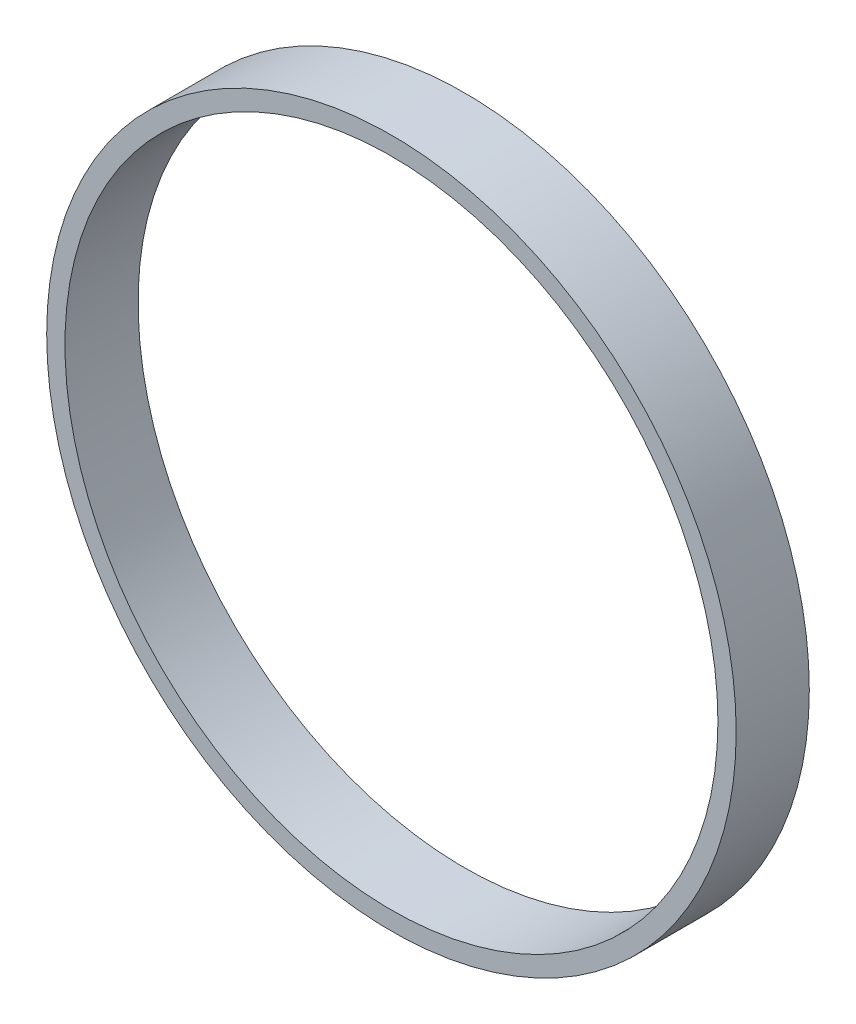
ISO-10303-21;
HEADER;
FILE_DESCRIPTION(('STEP AP214'),'2;1');
FILE_NAME('part.step','',(''),(''),'','','');
FILE_SCHEMA(('AUTOMOTIVE_DESIGN { 1 0 10303 214 1 1 1 1 }'));
ENDSEC;
DATA;
#1=APPLICATION_CONTEXT('core data for automotive mechanical design processes');
#2=APPLICATION_PROTOCOL_DEFINITION('international standard','automotive_design',2000,#1);
#3=PRODUCT_CONTEXT('',#1,'mechanical');
#4=PRODUCT('Part','Part','',(#3));
#5=PRODUCT_RELATED_PRODUCT_CATEGORY('part','',(#4));
#6=PRODUCT_DEFINITION_FORMATION('','',#4);
#7=PRODUCT_DEFINITION_CONTEXT('part definition',#1,'design');
#8=PRODUCT_DEFINITION('design','',#6,#7);
#9=PRODUCT_DEFINITION_SHAPE('','',#8);
#10=(LENGTH_UNIT() NAMED_UNIT(*) SI_UNIT(.MILLI.,.METRE.));
#11=(NAMED_UNIT(*) PLANE_ANGLE_UNIT() SI_UNIT($,.RADIAN.));
#12=(NAMED_UNIT(*) SI_UNIT($,.STERADIAN.) SOLID_ANGLE_UNIT());
#13=UNCERTAINTY_MEASURE_WITH_UNIT(LENGTH_MEASURE(1.E-05),#10,'distance_accuracy_value','');
#14=(GEOMETRIC_REPRESENTATION_CONTEXT(3) GLOBAL_UNCERTAINTY_ASSIGNED_CONTEXT((#13)) GLOBAL_UNIT_ASSIGNED_CONTEXT((#10,
#11,#12)) REPRESENTATION_CONTEXT('',''));
#15=CARTESIAN_POINT('',(0.,0.,0.));
#16=DIRECTION('',(0.,0.,1.));
#17=DIRECTION('',(1.,0.,0.));
#18=AXIS2_PLACEMENT_3D('',#15,#16,#17);
#19=CARTESIAN_POINT('',(0.,0.,3.5));
#20=DIRECTION('',(0.,0.,1.));
#21=DIRECTION('',(1.,0.,0.));
#22=AXIS2_PLACEMENT_3D('',#19,#20,#21);
#23=PLANE('',#22);
#24=CARTESIAN_POINT('',(0.,0.,3.5));
#25=DIRECTION('',(0.,0.,1.));
#26=DIRECTION('',(1.,0.,0.));
#27=AXIS2_PLACEMENT_3D('',#24,#25,#26);
#28=CIRCLE('',#27,33.);
#29=CARTESIAN_POINT('',(33.,0.,3.5));
#30=VERTEX_POINT('',#29);
#31=EDGE_CURVE('E10',#30,#30,#28,.T.);
#32=ORIENTED_EDGE('',*,*,#31,.T.);
#33=EDGE_LOOP('',(#32));
#34=FACE_BOUND('',#33,.T.);
#35=CARTESIAN_POINT('',(0.,0.,3.5));
#36=DIRECTION('',(0.,0.,1.));
#37=DIRECTION('',(1.,0.,0.));
#38=AXIS2_PLACEMENT_3D('',#35,#36,#37);
#39=CIRCLE('',#38,31.25);
#40=CARTESIAN_POINT('',(31.25,0.,3.5));
#41=VERTEX_POINT('',#40);
#42=EDGE_CURVE('E54',#41,#41,#39,.T.);
#43=ORIENTED_EDGE('',*,*,#42,.F.);
#44=EDGE_LOOP('',(#43));
#45=FACE_BOUND('',#44,.T.);
#46=ADVANCED_FACE('F41',(#34,#45),#23,.T.);
#47=CARTESIAN_POINT('',(0.,0.,-3.5));
#48=DIRECTION('',(0.,0.,1.));
#49=DIRECTION('',(1.,0.,0.));
#50=AXIS2_PLACEMENT_3D('',#47,#48,#49);
#51=PLANE('',#50);
#52=CARTESIAN_POINT('',(0.,0.,-3.5));
#53=DIRECTION('',(0.,0.,1.));
#54=DIRECTION('',(1.,0.,0.));
#55=AXIS2_PLACEMENT_3D('',#52,#53,#54);
#56=CIRCLE('',#55,33.);
#57=CARTESIAN_POINT('',(33.,0.,-3.5));
#58=VERTEX_POINT('',#57);
#59=EDGE_CURVE('E45',#58,#58,#56,.T.);
#60=ORIENTED_EDGE('',*,*,#59,.F.);
#61=EDGE_LOOP('',(#60));
#62=FACE_BOUND('',#61,.T.);
#63=CARTESIAN_POINT('',(0.,0.,-3.5));
#64=DIRECTION('',(0.,0.,1.));
#65=DIRECTION('',(1.,0.,0.));
#66=AXIS2_PLACEMENT_3D('',#63,#64,#65);
#67=CIRCLE('',#66,31.25);
#68=CARTESIAN_POINT('',(31.25,0.,-3.5));
#69=VERTEX_POINT('',#68);
#70=EDGE_CURVE('E56',#69,#69,#67,.T.);
#71=ORIENTED_EDGE('',*,*,#70,.T.);
#72=EDGE_LOOP('',(#71));
#73=FACE_BOUND('',#72,.T.);
#74=ADVANCED_FACE('F68',(#62,#73),#51,.F.);
#75=CARTESIAN_POINT('',(0.,0.,3.5));
#76=DIRECTION('',(0.,0.,-1.));
#77=DIRECTION('',(-1.,0.,0.));
#78=AXIS2_PLACEMENT_3D('',#75,#76,#77);
#79=CYLINDRICAL_SURFACE('',#78,33.);
#80=ORIENTED_EDGE('',*,*,#31,.F.);
#81=EDGE_LOOP('',(#80));
#82=FACE_BOUND('',#81,.T.);
#83=ORIENTED_EDGE('',*,*,#59,.T.);
#84=EDGE_LOOP('',(#83));
#85=FACE_BOUND('',#84,.T.);
#86=ADVANCED_FACE('F43',(#82,#85),#79,.T.);
#87=CARTESIAN_POINT('',(0.,0.,3.5));
#88=DIRECTION('',(0.,0.,-1.));
#89=DIRECTION('',(-1.,0.,0.));
#90=AXIS2_PLACEMENT_3D('',#87,#88,#89);
#91=CYLINDRICAL_SURFACE('',#90,31.25);
#92=ORIENTED_EDGE('',*,*,#42,.T.);
#93=EDGE_LOOP('',(#92));
#94=FACE_BOUND('',#93,.T.);
#95=ORIENTED_EDGE('',*,*,#70,.F.);
#96=EDGE_LOOP('',(#95));
#97=FACE_BOUND('',#96,.T.);
#98=ADVANCED_FACE('F64',(#94,#97),#91,.F.);
#99=CLOSED_SHELL('',(#46,#74,#86,#98));
#100=MANIFOLD_SOLID_BREP('B2',#99);
#101=ADVANCED_BREP_SHAPE_REPRESENTATION('',(#18,#100),#14);
#102=SHAPE_DEFINITION_REPRESENTATION(#9,#101);
ENDSEC;
END-ISO-10303-21;
